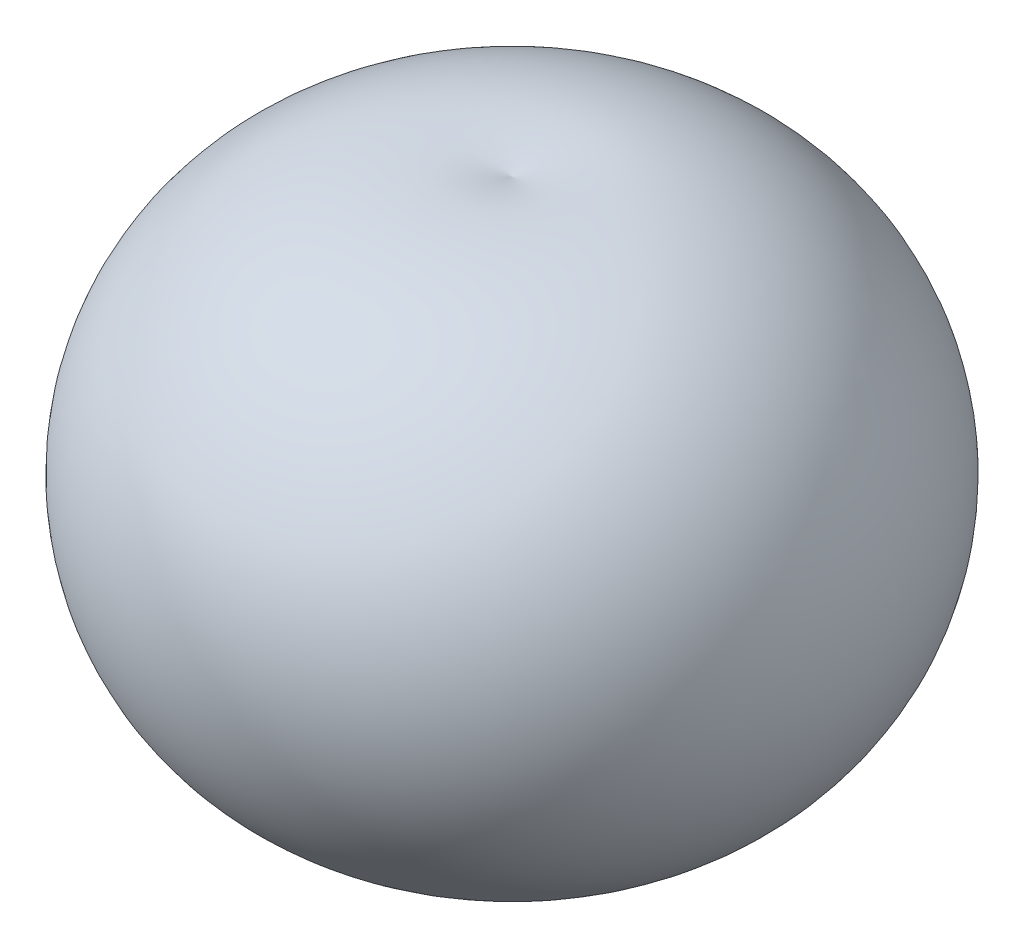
ISO-10303-21;
HEADER;
FILE_DESCRIPTION(('STEP AP214'),'2;1');
FILE_NAME('part.step','',(''),(''),'','','');
FILE_SCHEMA(('AUTOMOTIVE_DESIGN { 1 0 10303 214 1 1 1 1 }'));
ENDSEC;
DATA;
#1=APPLICATION_CONTEXT('core data for automotive mechanical design processes');
#2=APPLICATION_PROTOCOL_DEFINITION('international standard','automotive_design',2000,#1);
#3=PRODUCT_CONTEXT('',#1,'mechanical');
#4=PRODUCT('Part','Part','',(#3));
#5=PRODUCT_RELATED_PRODUCT_CATEGORY('part','',(#4));
#6=PRODUCT_DEFINITION_FORMATION('','',#4);
#7=PRODUCT_DEFINITION_CONTEXT('part definition',#1,'design');
#8=PRODUCT_DEFINITION('design','',#6,#7);
#9=PRODUCT_DEFINITION_SHAPE('','',#8);
#10=(LENGTH_UNIT() NAMED_UNIT(*) SI_UNIT(.MILLI.,.METRE.));
#11=(NAMED_UNIT(*) PLANE_ANGLE_UNIT() SI_UNIT($,.RADIAN.));
#12=(NAMED_UNIT(*) SI_UNIT($,.STERADIAN.) SOLID_ANGLE_UNIT());
#13=UNCERTAINTY_MEASURE_WITH_UNIT(LENGTH_MEASURE(1.E-05),#10,'distance_accuracy_value','');
#14=(GEOMETRIC_REPRESENTATION_CONTEXT(3) GLOBAL_UNCERTAINTY_ASSIGNED_CONTEXT((#13)) GLOBAL_UNIT_ASSIGNED_CONTEXT((#10,
#11,#12)) REPRESENTATION_CONTEXT('',''));
#15=CARTESIAN_POINT('',(0.,0.,0.));
#16=DIRECTION('',(0.,0.,1.));
#17=DIRECTION('',(1.,0.,0.));
#18=AXIS2_PLACEMENT_3D('',#15,#16,#17);
#19=CARTESIAN_POINT('',(-804.999999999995,-172.275496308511,0.));
#20=DIRECTION('',(0.,0.,-1.));
#21=DIRECTION('',(-1.,0.,0.));
#22=AXIS2_PLACEMENT_3D('',#19,#20,#21);
#23=CIRCLE('',#22,1455.);
#24=TRIMMED_CURVE('',#23,(PARAMETER_VALUE(-2.15707455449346)),
(PARAMETER_VALUE(2.15707455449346)),.T.,.PARAMETER.);
#25=CARTESIAN_POINT('',(3.33066907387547E-13,-172.275496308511,0.));
#26=DIRECTION('',(0.,1.,0.));
#27=AXIS1_PLACEMENT('',#25,#26);
#28=SURFACE_OF_REVOLUTION('',#24,#27);
#29=CARTESIAN_POINT('',(4.44089209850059E-13,-1384.29859839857,0.));
#30=VERTEX_POINT('',#29);
#31=VERTEX_LOOP('',#30);
#32=FACE_BOUND('',#31,.T.);
#33=CARTESIAN_POINT('',(5.3167620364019E-13,-1432.34245881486,0.));
#34=DIRECTION('',(0.,1.,0.));
#35=DIRECTION('',(-1.,0.,0.));
#36=AXIS2_PLACEMENT_3D('',#33,#34,#35);
#37=CIRCLE('',#36,1532.50000000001);
#38=CARTESIAN_POINT('',(-1532.50000000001,-1432.34245881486,0.));
#39=VERTEX_POINT('',#38);
#40=EDGE_CURVE('E62',#39,#39,#37,.T.);
#41=ORIENTED_EDGE('',*,*,#40,.F.);
#42=EDGE_LOOP('',(#41));
#43=FACE_BOUND('',#42,.T.);
#44=ADVANCED_FACE('F36',(#32,#43),#28,.T.);
#45=CARTESIAN_POINT('',(-500.,356.,0.));
#46=DIRECTION('',(0.,0.,-1.));
#47=DIRECTION('',(-1.,0.,0.));
#48=AXIS2_PLACEMENT_3D('',#45,#46,#47);
#49=CIRCLE('',#48,2065.);
#50=TRIMMED_CURVE('',#49,(PARAMETER_VALUE(-1.8153576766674)),(PARAMETER_VALUE(1.8153576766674)),
.T.,.PARAMETER.);
#51=CARTESIAN_POINT('',(2.77555756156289E-13,356.,0.));
#52=DIRECTION('',(0.,1.,0.));
#53=AXIS1_PLACEMENT('',#51,#52);
#54=SURFACE_OF_REVOLUTION('',#50,#53);
#55=ORIENTED_EDGE('',*,*,#40,.T.);
#56=EDGE_LOOP('',(#55));
#57=FACE_BOUND('',#56,.T.);
#58=CARTESIAN_POINT('',(0.,2359.55309388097,0.));
#59=VERTEX_POINT('',#58);
#60=VERTEX_LOOP('',#59);
#61=FACE_BOUND('',#60,.T.);
#62=ADVANCED_FACE('F59',(#57,#61),#54,.T.);
#63=CLOSED_SHELL('',(#44,#62));
#64=CARTESIAN_POINT('',(-500.,356.,0.));
#65=DIRECTION('',(0.,0.,-1.));
#66=DIRECTION('',(-1.,0.,0.));
#67=AXIS2_PLACEMENT_3D('',#64,#65,#66);
#68=CIRCLE('',#67,931.391678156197);
#69=TRIMMED_CURVE('',#68,(PARAMETER_VALUE(-2.13747290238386)),
(PARAMETER_VALUE(2.13747290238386)),.T.,.PARAMETER.);
#70=CARTESIAN_POINT('',(2.77555756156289E-13,356.,0.));
#71=DIRECTION('',(0.,1.,0.));
#72=AXIS1_PLACEMENT('',#70,#71);
#73=SURFACE_OF_REVOLUTION('',#69,#72);
#74=CARTESIAN_POINT('',(2.82694144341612E-13,619.739239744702,0.));
#75=DIRECTION('',(0.,1.,0.));
#76=DIRECTION('',(-1.,0.,0.));
#77=AXIS2_PLACEMENT_3D('',#74,#75,#76);
#78=CIRCLE('',#77,1393.27043584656);
#79=CARTESIAN_POINT('',(-1393.27043584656,619.739239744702,0.));
#80=VERTEX_POINT('',#79);
#81=EDGE_CURVE('E11',#80,#80,#78,.T.);
#82=ORIENTED_EDGE('',*,*,#81,.T.);
#83=EDGE_LOOP('',(#82));
#84=FACE_BOUND('',#83,.T.);
#85=CARTESIAN_POINT('',(0.,-429.805610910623,0.));
#86=VERTEX_POINT('',#85);
#87=VERTEX_LOOP('',#86);
#88=FACE_BOUND('',#87,.T.);
#89=ADVANCED_FACE('F78',(#84,#88),#73,.F.);
#90=CARTESIAN_POINT('',(2.84494650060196E-13,594.345988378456,0.));
#91=DIRECTION('',(0.,1.,0.));
#92=DIRECTION('',(-1.,0.,0.));
#93=AXIS2_PLACEMENT_3D('',#90,#91,#92);
#94=DEGENERATE_TOROIDAL_SURFACE('',#93,61.5079606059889,1455.,.F.);
#95=CARTESIAN_POINT('',(1.37718533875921E-13,1814.61166473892,0.));
#96=DIRECTION('',(0.,1.,0.));
#97=DIRECTION('',(-1.,0.,0.));
#98=AXIS2_PLACEMENT_3D('',#95,#96,#97);
#99=CIRCLE('',#98,730.941835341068);
#100=CARTESIAN_POINT('',(-730.941835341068,1814.61166473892,0.));
#101=VERTEX_POINT('',#100);
#102=EDGE_CURVE('E44',#101,#101,#99,.T.);
#103=ORIENTED_EDGE('',*,*,#102,.T.);
#104=EDGE_LOOP('',(#103));
#105=FACE_BOUND('',#104,.T.);
#106=ORIENTED_EDGE('',*,*,#81,.F.);
#107=EDGE_LOOP('',(#106));
#108=FACE_BOUND('',#107,.T.);
#109=ADVANCED_FACE('F68',(#105,#108),#94,.T.);
#110=CARTESIAN_POINT('',(-500.,356.,0.));
#111=DIRECTION('',(0.,0.,-1.));
#112=DIRECTION('',(-1.,0.,0.));
#113=AXIS2_PLACEMENT_3D('',#110,#111,#112);
#114=CIRCLE('',#113,1476.78099927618);
#115=TRIMMED_CURVE('',#114,(PARAMETER_VALUE(-1.91619755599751)),
(PARAMETER_VALUE(1.91619755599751)),.T.,.PARAMETER.);
#116=CARTESIAN_POINT('',(2.77555756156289E-13,356.,0.));
#117=DIRECTION('',(0.,1.,0.));
#118=AXIS1_PLACEMENT('',#116,#117);
#119=SURFACE_OF_REVOLUTION('',#115,#118);
#120=CARTESIAN_POINT('',(1.66533453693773E-13,1745.56184454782,0.));
#121=VERTEX_POINT('',#120);
#122=VERTEX_LOOP('',#121);
#123=FACE_BOUND('',#122,.T.);
#124=ORIENTED_EDGE('',*,*,#102,.F.);
#125=EDGE_LOOP('',(#124));
#126=FACE_BOUND('',#125,.T.);
#127=ADVANCED_FACE('F71',(#123,#126),#119,.F.);
#128=CLOSED_SHELL('',(#89,#109,#127));
#129=ORIENTED_CLOSED_SHELL('',*,#128,.T.);
#130=BREP_WITH_VOIDS('B2',#63,(#129));
#131=ADVANCED_BREP_SHAPE_REPRESENTATION('',(#18,#130),#14);
#132=SHAPE_DEFINITION_REPRESENTATION(#9,#131);
ENDSEC;
END-ISO-10303-21;
